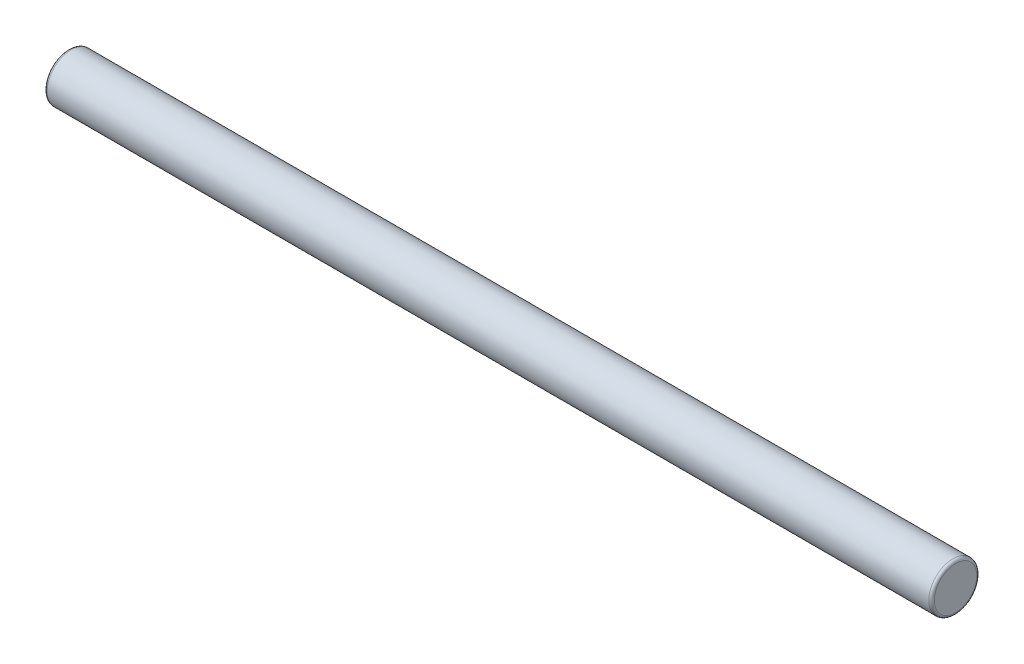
from build123d import *

# Parameters (mm, degrees)
SCHIZZO1_W  = 646
SCHIZZO1_H  = 17.5
RACCORDO1_R = 2


with BuildPart() as part:
    # Schizzo1 → Rivoluzione1 (revolve)
    with BuildSketch(Plane.XY, mode=Mode.PRIVATE) as rivoluzione1_sk:
        with Locations((0, 8.75)):
            Rectangle(SCHIZZO1_W, SCHIZZO1_H)
    revolve(rivoluzione1_sk.sketch.rotate(Axis((-323, 0, 0), (1, 0, 0)), 180), axis=Axis((-323, 0, 0), (1, 0, 0)))

    # Raccordo1
    raccordo1_edges = [part.edges().sort_by_distance(p)[0] for p in [
        (323, 17.5, 0),
        (-323, 17.5, 0),
    ]]
    fillet(raccordo1_edges, radius=RACCORDO1_R)


solid = part.part
